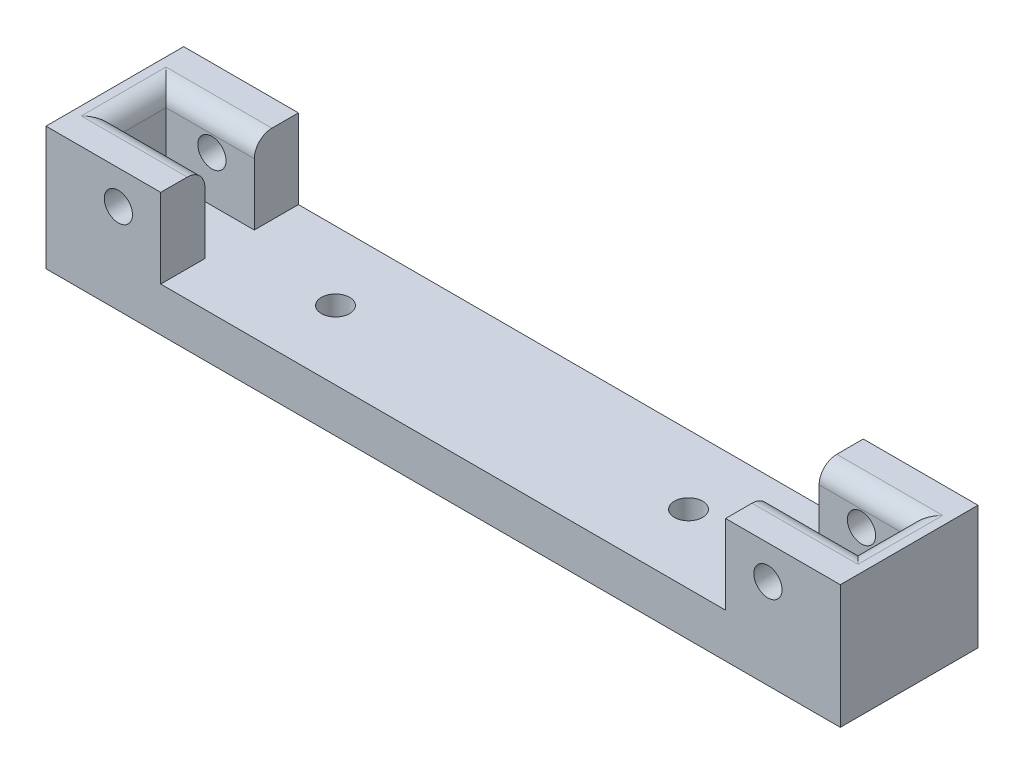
from build123d import *

# Parameters (mm, degrees)
SKETCH1_W            = 114.3
SKETCH1_H            = 19.812
BOSS_EXTRUDE1_DEPTH  = 6.35
SKETCH2_W            = 3.81
SKETCH2_H            = 19.812
BOSS_EXTRUDE2_DEPTH  = 11.43
SKETCH3_W            = 12.7
SKETCH3_H            = 6.35
BOSS_EXTRUDE3_DEPTH  = 11.43
SKETCH6_R            = 2.032
CUT_EXTRUDE1_DEPTH   = 118.358995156
FILLET1_R            = 2.54
FILLET2_R            = 2.54
FILLET1_OF_MIRROR2_R = 2.54
FILLET2_OF_MIRROR2_R = 2.54
SKETCH10_R           = 2.032
CUT_EXTRUDE2_DEPTH   = 117.566076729


with BuildPart() as part:
    # Sketch1 → Boss-Extrude1 (new body)
    with BuildSketch(Plane(origin=(0, 0, 0), x_dir=(1, 0, 0), z_dir=(0, 1, 0))):
        with Locations((57.15, 9.906)):
            Rectangle(SKETCH1_W, SKETCH1_H)
    extrude(amount=BOSS_EXTRUDE1_DEPTH)

    # Sketch2 → Boss-Extrude2 (add)
    with BuildSketch(Plane(origin=(0, 6.35, 0), x_dir=(1, 0, 0), z_dir=(0, 1, 0))):
        with Locations((1.905, 9.906)):
            Rectangle(SKETCH2_W, SKETCH2_H)
    boss_extrude2 = extrude(amount=BOSS_EXTRUDE2_DEPTH)

    # Sketch3 → Boss-Extrude3 (add)
    with BuildSketch(Plane(origin=(0, 6.35, 0), x_dir=(1, 0, 0), z_dir=(0, 1, 0))):
        with Locations((10.16, 3.175)):
            Rectangle(SKETCH3_W, SKETCH3_H)
        with Locations((10.16, 16.637)):
            Rectangle(SKETCH3_W, SKETCH3_H)
    boss_extrude3 = extrude(amount=BOSS_EXTRUDE3_DEPTH)

    # Sketch6 → Cut-Extrude1 (cut, through all)
    with BuildSketch(Plane.XY):
        with Locations((10.414, 12.954)):
            Circle(SKETCH6_R)
    cut_extrude1 = extrude(amount=-CUT_EXTRUDE1_DEPTH, mode=Mode.SUBTRACT)

    # Fillet1
    fillet1_edges = [part.edges().sort_by_distance(p)[0] for p in [
        (10.16, 17.78, -6.35),
    ]]
    fillet(fillet1_edges, radius=FILLET1_R)

    # Fillet2
    fillet2_edges = [part.edges().sort_by_distance(p)[0] for p in [
        (10.16, 17.78, -13.462),
        (3.81, 17.78, -8.636),
    ]]
    fillet(fillet2_edges, radius=FILLET2_R)

    # Mirror2: Boss-Extrude2, Boss-Extrude3, Cut-Extrude1 across plane
    add(boss_extrude2.mirror(Plane.ZY.offset(-57.15)))
    add(boss_extrude3.mirror(Plane.ZY.offset(-57.15)))
    add(cut_extrude1.mirror(Plane.ZY.offset(-57.15)), mode=Mode.SUBTRACT)

    # Fillet1 of Mirror2
    fillet1_of_mirror2_edges = [part.edges().sort_by_distance(p)[0] for p in [
        (104.14, 17.78, -6.35),
    ]]
    fillet(fillet1_of_mirror2_edges, radius=FILLET1_OF_MIRROR2_R)

    # Fillet2 of Mirror2
    fillet2_of_mirror2_edges = [part.edges().sort_by_distance(p)[0] for p in [
        (104.14, 17.78, -13.462),
        (110.49, 17.78, -8.636),
    ]]
    fillet(fillet2_of_mirror2_edges, radius=FILLET2_OF_MIRROR2_R)

    # Sketch10 → Cut-Extrude2 (cut, through all)
    with BuildSketch(Plane(origin=(0, 6.35, 0), x_dir=(1, 0, 0), z_dir=(0, 1, 0))):
        with Locations(Location((31.75, 9.906, 0), (0, 0, 270))):
            Circle(SKETCH10_R)
    cut_extrude2 = extrude(amount=-CUT_EXTRUDE2_DEPTH, mode=Mode.SUBTRACT)

    # Mirror4: Cut-Extrude2 across plane
    add(cut_extrude2.mirror(Plane.ZY.offset(-57.15)), mode=Mode.SUBTRACT)


solid = part.part
